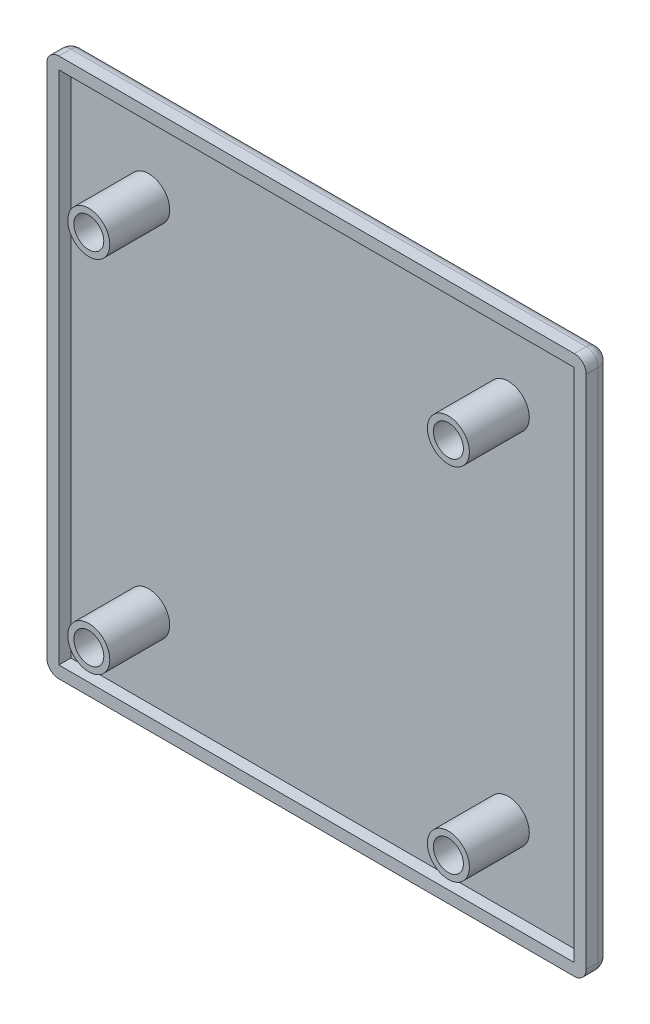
from build123d import *

# Parameters (mm, degrees)
SKETCH_2_W      = 90
SKETCH_2_H      = 90
EXTRUDE_1_DEPTH = 2
SHELL_1_T       = -2
FILLET_1_R      = 2
SKETCH_3_R      = 3.5
SKETCH_3_R_2    = 2.5
EXTRUDE_2_DEPTH = 10


with BuildPart() as part:
    # Sketch 2 → Extrude 1 (new, symmetric)
    with BuildSketch(Plane.XY):
        Rectangle(SKETCH_2_W, SKETCH_2_H)
    extrude(amount=EXTRUDE_1_DEPTH, both=True)

    # Shell 1
    shell_1_openings = [part.faces().sort_by_distance(p)[0] for p in [
        (0, 0, 2),
    ]]
    offset(amount=SHELL_1_T, openings=shell_1_openings, kind=Kind.INTERSECTION)

    # Fillet 1
    fillet_1_edges = [part.edges().sort_by_distance(p)[0] for p in [
        (0, 45, -2),
        (45, 0, -2),
        (0, -45, -2),
        (-45, 0, -2),
        (-45, 45, 0),
        (45, 45, 0),
        (45, -45, 0),
        (-45, -45, 0),
    ]]
    fillet(fillet_1_edges, radius=FILLET_1_R)

    # Sketch 3 → Extrude 2 (add)
    # profile 1 of 4: a face of its own
    with BuildSketch(Plane.XY):
        with Locations((-30, 30)):
            Circle(SKETCH_3_R)
        with Locations((-30, 30)):
            Circle(SKETCH_3_R_2, mode=Mode.SUBTRACT)
    # profile 2 of 4: a face of its own
    with BuildSketch(Plane.XY):
        with Locations((30, 30)):
            Circle(SKETCH_3_R)
        with Locations((30, 30)):
            Circle(SKETCH_3_R_2, mode=Mode.SUBTRACT)
    # profile 3 of 4: a face of its own
    with BuildSketch(Plane.XY):
        with Locations((30, -30)):
            Circle(SKETCH_3_R)
        with Locations((30, -30)):
            Circle(SKETCH_3_R_2, mode=Mode.SUBTRACT)
    # profile 4 of 4: a face of its own
    with BuildSketch(Plane.XY):
        with Locations((-30, -30)):
            Circle(SKETCH_3_R)
        with Locations((-30, -30)):
            Circle(SKETCH_3_R_2, mode=Mode.SUBTRACT)
    extrude(amount=EXTRUDE_2_DEPTH)


solid = part.part
